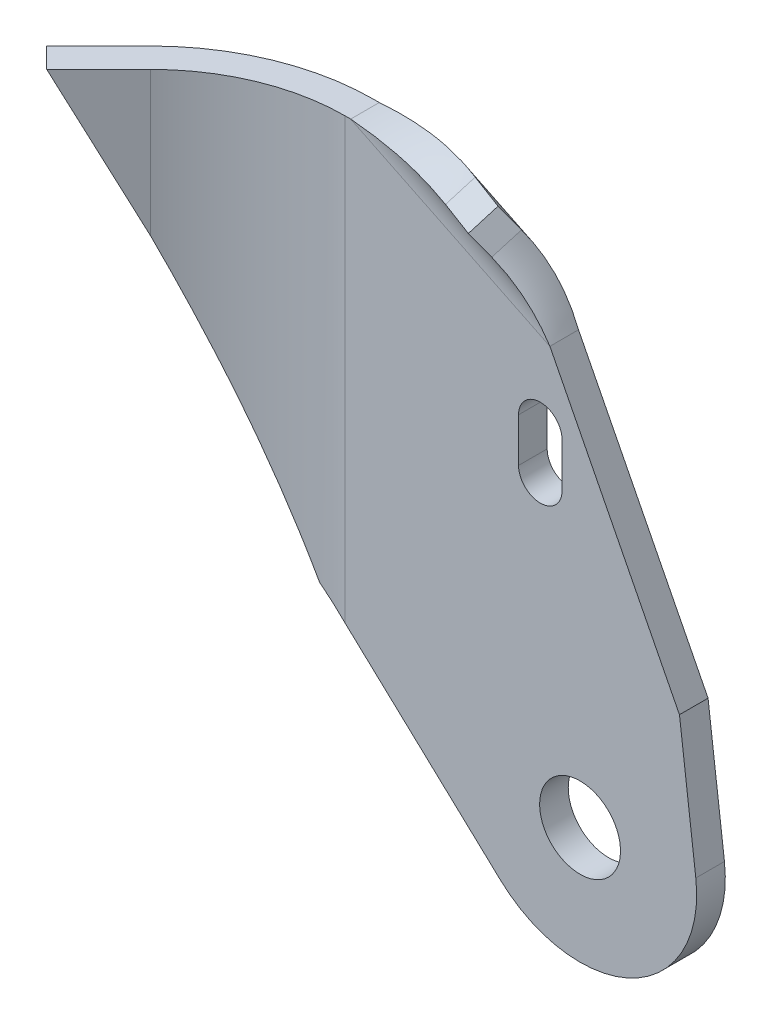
ISO-10303-21;
HEADER;
FILE_DESCRIPTION(('STEP AP214'),'2;1');
FILE_NAME('part.step','',(''),(''),'','','');
FILE_SCHEMA(('AUTOMOTIVE_DESIGN { 1 0 10303 214 1 1 1 1 }'));
ENDSEC;
DATA;
#1=APPLICATION_CONTEXT('core data for automotive mechanical design processes');
#2=APPLICATION_PROTOCOL_DEFINITION('international standard','automotive_design',2000,#1);
#3=PRODUCT_CONTEXT('',#1,'mechanical');
#4=PRODUCT('Part','Part','',(#3));
#5=PRODUCT_RELATED_PRODUCT_CATEGORY('part','',(#4));
#6=PRODUCT_DEFINITION_FORMATION('','',#4);
#7=PRODUCT_DEFINITION_CONTEXT('part definition',#1,'design');
#8=PRODUCT_DEFINITION('design','',#6,#7);
#9=PRODUCT_DEFINITION_SHAPE('','',#8);
#10=(LENGTH_UNIT() NAMED_UNIT(*) SI_UNIT(.MILLI.,.METRE.));
#11=(NAMED_UNIT(*) PLANE_ANGLE_UNIT() SI_UNIT($,.RADIAN.));
#12=(NAMED_UNIT(*) SI_UNIT($,.STERADIAN.) SOLID_ANGLE_UNIT());
#13=UNCERTAINTY_MEASURE_WITH_UNIT(LENGTH_MEASURE(1.E-05),#10,'distance_accuracy_value','');
#14=(GEOMETRIC_REPRESENTATION_CONTEXT(3) GLOBAL_UNCERTAINTY_ASSIGNED_CONTEXT((#13)) GLOBAL_UNIT_ASSIGNED_CONTEXT((#10,
#11,#12)) REPRESENTATION_CONTEXT('',''));
#15=CARTESIAN_POINT('',(0.,0.,0.));
#16=DIRECTION('',(0.,0.,1.));
#17=DIRECTION('',(1.,0.,0.));
#18=AXIS2_PLACEMENT_3D('',#15,#16,#17);
#19=CARTESIAN_POINT('',(22.5526101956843,-81.2419000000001,-71.8145263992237));
#20=DIRECTION('',(0.707106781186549,0.,0.707106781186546));
#21=DIRECTION('',(0.707106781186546,0.,-0.707106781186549));
#22=AXIS2_PLACEMENT_3D('',#19,#20,#21);
#23=PLANE('',#22);
#24=DIRECTION('',(-0.321019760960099,0.89100652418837,0.3210197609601));
#25=VECTOR('',#24,1.);
#26=CARTESIAN_POINT('',(-32.0018250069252,0.241299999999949,-17.260091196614));
#27=LINE('',#26,#25);
#28=CARTESIAN_POINT('',(-23.5065416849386,-23.3377869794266,-25.7553745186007));
#29=VERTEX_POINT('',#28);
#30=CARTESIAN_POINT('',(-32.0018250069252,0.241299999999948,-17.260091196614));
#31=VERTEX_POINT('',#30);
#32=EDGE_CURVE('E163',#29,#31,#27,.T.);
#33=ORIENTED_EDGE('',*,*,#32,.T.);
#34=DIRECTION('',(-0.707106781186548,0.,0.707106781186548));
#35=VECTOR('',#34,1.);
#36=CARTESIAN_POINT('',(-23.506541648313,0.241299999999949,-25.7553745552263));
#37=LINE('',#36,#35);
#38=CARTESIAN_POINT('',(-23.506541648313,0.241299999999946,-25.7553745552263));
#39=VERTEX_POINT('',#38);
#40=EDGE_CURVE('E165',#39,#31,#37,.T.);
#41=ORIENTED_EDGE('',*,*,#40,.F.);
#42=DIRECTION('',(0.,-1.,0.));
#43=VECTOR('',#42,1.);
#44=CARTESIAN_POINT('',(-23.506541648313,139.466006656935,-25.7553745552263));
#45=LINE('',#44,#43);
#46=EDGE_CURVE('E167',#29,#39,#45,.F.);
#47=ORIENTED_EDGE('',*,*,#46,.F.);
#48=EDGE_LOOP('',(#33,#41,#47));
#49=FACE_BOUND('',#48,.T.);
#50=ADVANCED_FACE('F16',(#49),#23,.F.);
#51=CARTESIAN_POINT('',(48.3093374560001,-65.4653502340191,-76.4626144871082));
#52=DIRECTION('',(-0.293327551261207,-0.601410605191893,0.743144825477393));
#53=DIRECTION('',(0.,-0.777338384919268,-0.629082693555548));
#54=AXIS2_PLACEMENT_3D('',#51,#52,#53);
#55=PLANE('',#54);
#56=DIRECTION('',(-0.950640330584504,0.101202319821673,-0.293327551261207));
#57=VECTOR('',#56,1.);
#58=CARTESIAN_POINT('',(27.6945736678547,0.427162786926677,-31.2741440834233));
#59=LINE('',#58,#57);
#60=CARTESIAN_POINT('',(27.6945736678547,0.427162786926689,-31.2741440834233));
#61=VERTEX_POINT('',#60);
#62=CARTESIAN_POINT('',(22.2966394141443,1.00181068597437,-32.9397191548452));
#63=VERTEX_POINT('',#62);
#64=EDGE_CURVE('E183',#61,#63,#59,.T.);
#65=ORIENTED_EDGE('',*,*,#64,.F.);
#66=DIRECTION('',(-0.521753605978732,0.752071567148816,0.402692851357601));
#67=VECTOR('',#66,1.);
#68=CARTESIAN_POINT('',(29.8525950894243,-2.6834751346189,-32.9397191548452));
#69=LINE('',#68,#67);
#70=CARTESIAN_POINT('',(29.8525950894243,-2.6834751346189,-32.9397191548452));
#71=VERTEX_POINT('',#70);
#72=EDGE_CURVE('E189',#71,#61,#69,.T.);
#73=ORIENTED_EDGE('',*,*,#72,.F.);
#74=DIRECTION('',(-0.898794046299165,0.438371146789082,0.));
#75=VECTOR('',#74,1.);
#76=CARTESIAN_POINT('',(179.313545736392,-75.5804514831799,-32.9397191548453));
#77=LINE('',#76,#75);
#78=EDGE_CURVE('E138',#63,#71,#77,.F.);
#79=ORIENTED_EDGE('',*,*,#78,.F.);
#80=EDGE_LOOP('',(#65,#73,#79));
#81=FACE_BOUND('',#80,.T.);
#82=ADVANCED_FACE('F380',(#81),#55,.F.);
#83=CARTESIAN_POINT('',(-34.6512906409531,4.10762255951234,-46.6152886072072));
#84=DIRECTION('',(-0.101202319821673,0.792504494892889,0.601410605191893));
#85=DIRECTION('',(0.,-0.604514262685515,0.796594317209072));
#86=AXIS2_PLACEMENT_3D('',#83,#84,#85);
#87=PLANE('',#86);
#88=DIRECTION('',(-0.950640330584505,0.101202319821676,-0.293327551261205));
#89=VECTOR('',#88,1.);
#90=CARTESIAN_POINT('',(26.3236780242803,-2.38358981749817,-27.8009824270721));
#91=LINE('',#90,#89);
#92=CARTESIAN_POINT('',(26.3236780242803,-2.38358981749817,-27.8009824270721));
#93=VERTEX_POINT('',#92);
#94=CARTESIAN_POINT('',(20.92574377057,-1.80894191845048,-29.4665574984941));
#95=VERTEX_POINT('',#94);
#96=EDGE_CURVE('E154',#93,#95,#91,.T.);
#97=ORIENTED_EDGE('',*,*,#96,.F.);
#98=DIRECTION('',(-0.293327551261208,-0.601410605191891,0.743144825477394));
#99=VECTOR('',#98,1.);
#100=CARTESIAN_POINT('',(27.6945736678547,0.427162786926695,-31.2741440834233));
#101=LINE('',#100,#99);
#102=EDGE_CURVE('E192',#61,#93,#101,.T.);
#103=ORIENTED_EDGE('',*,*,#102,.F.);
#104=ORIENTED_EDGE('',*,*,#64,.T.);
#105=DIRECTION('',(0.293327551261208,0.601410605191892,-0.743144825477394));
#106=VECTOR('',#105,1.);
#107=CARTESIAN_POINT('',(21.6111921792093,-0.403564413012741,-31.2031398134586));
#108=LINE('',#107,#106);
#109=EDGE_CURVE('E199',#95,#63,#108,.T.);
#110=ORIENTED_EDGE('',*,*,#109,.F.);
#111=EDGE_LOOP('',(#97,#103,#104,#110));
#112=FACE_BOUND('',#111,.T.);
#113=ADVANCED_FACE('F383',(#112),#87,.T.);
#114=CARTESIAN_POINT('',(-28.6970907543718,0.241299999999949,-13.9553569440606));
#115=DIRECTION('',(0.630036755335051,0.453990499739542,-0.630036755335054));
#116=DIRECTION('',(-0.707106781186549,0.,-0.707106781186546));
#117=AXIS2_PLACEMENT_3D('',#114,#115,#116);
#118=PLANE('',#117);
#119=DIRECTION('',(0.321019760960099,-0.89100652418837,-0.3210197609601));
#120=VECTOR('',#119,1.);
#121=CARTESIAN_POINT('',(-28.6970907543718,0.241299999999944,-13.9553569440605));
#122=LINE('',#121,#120);
#123=CARTESIAN_POINT('',(-28.6970907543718,0.241299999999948,-13.9553569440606));
#124=VERTEX_POINT('',#123);
#125=CARTESIAN_POINT('',(-20.2018074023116,-23.3377870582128,-22.4506402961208));
#126=VERTEX_POINT('',#125);
#127=EDGE_CURVE('E187',#124,#126,#122,.T.);
#128=ORIENTED_EDGE('',*,*,#127,.F.);
#129=DIRECTION('',(-0.707106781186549,0.,-0.707106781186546));
#130=VECTOR('',#129,1.);
#131=CARTESIAN_POINT('',(-28.6970907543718,0.241299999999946,-13.9553569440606));
#132=LINE('',#131,#130);
#133=EDGE_CURVE('E173',#31,#124,#132,.F.);
#134=ORIENTED_EDGE('',*,*,#133,.F.);
#135=ORIENTED_EDGE('',*,*,#32,.F.);
#136=DIRECTION('',(0.707106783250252,-1.73709898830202E-13,0.707106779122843));
#137=VECTOR('',#136,1.);
#138=CARTESIAN_POINT('',(-21.8541745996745,-23.3377868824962,-24.1030073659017));
#139=LINE('',#138,#137);
#140=CARTESIAN_POINT('',(-21.8541711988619,-23.3377869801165,-24.1030040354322));
#141=VERTEX_POINT('',#140);
#142=EDGE_CURVE('E342',#29,#141,#139,.T.);
#143=ORIENTED_EDGE('',*,*,#142,.T.);
#144=DIRECTION('',(0.707106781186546,0.,0.707106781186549));
#145=VECTOR('',#144,1.);
#146=CARTESIAN_POINT('',(-21.8541745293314,-23.3377870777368,-24.1030074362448));
#147=LINE('',#146,#145);
#148=EDGE_CURVE('E284',#141,#126,#147,.T.);
#149=ORIENTED_EDGE('',*,*,#148,.T.);
#150=EDGE_LOOP('',(#128,#134,#135,#143,#149));
#151=FACE_BOUND('',#150,.T.);
#152=ADVANCED_FACE('F185',(#151),#118,.F.);
#153=CARTESIAN_POINT('',(26.3236780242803,-2.38358981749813,-27.8009824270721));
#154=DIRECTION('',(0.80108184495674,0.269617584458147,0.534391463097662));
#155=DIRECTION('',(0.554942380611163,0.,-0.831888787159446));
#156=AXIS2_PLACEMENT_3D('',#153,#154,#155);
#157=PLANE('',#156);
#158=ORIENTED_EDGE('',*,*,#72,.T.);
#159=ORIENTED_EDGE('',*,*,#102,.T.);
#160=DIRECTION('',(-0.521753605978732,0.752071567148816,0.402692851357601));
#161=VECTOR('',#160,1.);
#162=CARTESIAN_POINT('',(28.4816994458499,-5.49422773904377,-29.466557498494));
#163=LINE('',#162,#161);
#164=CARTESIAN_POINT('',(28.4816994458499,-5.49422773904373,-29.466557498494));
#165=VERTEX_POINT('',#164);
#166=EDGE_CURVE('E302',#165,#93,#163,.T.);
#167=ORIENTED_EDGE('',*,*,#166,.F.);
#168=DIRECTION('',(-0.293327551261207,-0.601410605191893,0.743144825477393));
#169=VECTOR('',#168,1.);
#170=CARTESIAN_POINT('',(29.1671483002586,-4.08884931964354,-31.2031409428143));
#171=LINE('',#170,#169);
#172=EDGE_CURVE('E348',#71,#165,#171,.T.);
#173=ORIENTED_EDGE('',*,*,#172,.F.);
#174=EDGE_LOOP('',(#158,#159,#167,#173));
#175=FACE_BOUND('',#174,.T.);
#176=ADVANCED_FACE('F329',(#175),#157,.T.);
#177=CARTESIAN_POINT('',(2.2488329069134,139.466006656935,0.));
#178=DIRECTION('',(0.,-1.,0.));
#179=DIRECTION('',(0.,0.,-1.));
#180=AXIS2_PLACEMENT_3D('',#177,#178,#179);
#181=CYLINDRICAL_SURFACE('',#180,36.4236);
#182=DIRECTION('',(0.,1.,0.));
#183=VECTOR('',#182,1.);
#184=CARTESIAN_POINT('',(2.2488329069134,-81.2419000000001,-36.4236));
#185=LINE('',#184,#183);
#186=CARTESIAN_POINT('',(2.2488329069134,0.241299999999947,-36.4236));
#187=VERTEX_POINT('',#186);
#188=CARTESIAN_POINT('',(2.2488329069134,-71.5128315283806,-36.4236));
#189=VERTEX_POINT('',#188);
#190=EDGE_CURVE('E352',#187,#189,#185,.F.);
#191=ORIENTED_EDGE('',*,*,#190,.T.);
#192=CARTESIAN_POINT('',(2.2488329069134,-71.5128315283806,-36.4236));
#193=CARTESIAN_POINT('',(2.06006403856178,-71.3480951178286,-36.4236001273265));
#194=CARTESIAN_POINT('',(1.87129517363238,-71.1833587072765,-36.4221325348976));
#195=CARTESIAN_POINT('',(1.49380307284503,-70.8538858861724,-36.4162628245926));
#196=CARTESIAN_POINT('',(1.30507983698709,-70.6891494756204,-36.4118607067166));
#197=CARTESIAN_POINT('',(0.927724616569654,-70.3596766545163,-36.4001228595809));
#198=CARTESIAN_POINT('',(0.739092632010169,-70.1949402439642,-36.3927871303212));
#199=CARTESIAN_POINT('',(0.361965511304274,-69.8654674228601,-36.3751838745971));
#200=CARTESIAN_POINT('',(0.173470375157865,-69.7007310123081,-36.3649163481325));
#201=CARTESIAN_POINT('',(-0.203337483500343,-69.371258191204,-36.3414519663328));
#202=CARTESIAN_POINT('',(-0.391650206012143,-69.2065217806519,-36.3282551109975));
#203=CARTESIAN_POINT('',(-0.768047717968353,-68.8770489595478,-36.298935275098));
#204=CARTESIAN_POINT('',(-0.956132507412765,-68.7123125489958,-36.2828122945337));
#205=CARTESIAN_POINT('',(-1.33202868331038,-68.3828397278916,-36.2476440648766));
#206=CARTESIAN_POINT('',(-1.51984006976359,-68.2181033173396,-36.2285988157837));
#207=CARTESIAN_POINT('',(-1.89514405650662,-67.8886304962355,-36.1875908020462));
#208=CARTESIAN_POINT('',(-2.08263665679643,-67.7238940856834,-36.1656280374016));
#209=CARTESIAN_POINT('',(-2.26994717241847,-67.5591576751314,-36.1422088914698));
#210=B_SPLINE_CURVE_WITH_KNOTS('',3,(#192,#193,#194,#195,#196,#197,#198,#199,#200,#201,#202,
#203,#204,#205,#206,#207,#208,#209),.UNSPECIFIED.,.F.,.F.,(4,2,2,2,2,2,2,2,4),(0.,
0.751624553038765,1.50324910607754,2.2548736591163,3.00649821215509,3.75812276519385,
4.50974731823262,5.26137187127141,6.01299642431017),.UNSPECIFIED.);
#211=CARTESIAN_POINT('',(-2.26994740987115,-67.559157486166,-36.1422088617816));
#212=VERTEX_POINT('',#211);
#213=EDGE_CURVE('E283',#212,#189,#210,.F.);
#214=ORIENTED_EDGE('',*,*,#213,.F.);
#215=CARTESIAN_POINT('',(-2.26994764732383,-67.5591572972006,-36.1422088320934));
#216=CARTESIAN_POINT('',(-3.02140147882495,-66.1682044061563,-36.0482882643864));
#217=CARTESIAN_POINT('',(-3.76991118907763,-64.7772567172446,-35.9308707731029));
#218=CARTESIAN_POINT('',(-5.25832548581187,-61.9950801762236,-35.6496049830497));
#219=CARTESIAN_POINT('',(-5.99822826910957,-60.6038513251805,-35.485747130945));
#220=CARTESIAN_POINT('',(-7.51450813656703,-57.7302198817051,-35.09996276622));
#221=CARTESIAN_POINT('',(-8.29009782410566,-56.2478172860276,-34.8749344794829));
#222=CARTESIAN_POINT('',(-9.82464178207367,-53.2829260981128,-34.3738465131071));
#223=CARTESIAN_POINT('',(-10.583595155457,-51.8004375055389,-34.0977840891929));
#224=CARTESIAN_POINT('',(-12.0816245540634,-48.8351428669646,-33.4957969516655));
#225=CARTESIAN_POINT('',(-12.8206963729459,-47.352336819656,-33.169861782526));
#226=CARTESIAN_POINT('',(-14.2755498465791,-44.3867358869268,-32.4696024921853));
#227=CARTESIAN_POINT('',(-14.9913319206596,-42.9039410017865,-32.0952792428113));
#228=CARTESIAN_POINT('',(-16.1699027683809,-40.416494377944,-31.4281419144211));
#229=CARTESIAN_POINT('',(-16.6398527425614,-39.4118232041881,-31.1479603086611));
#230=CARTESIAN_POINT('',(-17.5666747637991,-37.4024721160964,-30.5667054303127));
#231=CARTESIAN_POINT('',(-18.0235467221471,-36.3977922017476,-30.2656320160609));
#232=CARTESIAN_POINT('',(-18.923269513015,-34.3884320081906,-29.6432108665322));
#233=CARTESIAN_POINT('',(-19.3661202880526,-33.3837517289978,-29.3218630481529));
#234=CARTESIAN_POINT('',(-20.2368519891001,-31.3744868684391,-28.6595845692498));
#235=CARTESIAN_POINT('',(-20.6647343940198,-30.3699022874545,-28.3186558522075));
#236=CARTESIAN_POINT('',(-21.5047004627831,-28.3607283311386,-27.6178819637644));
#237=CARTESIAN_POINT('',(-21.9167841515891,-27.3561389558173,-27.2580368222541));
#238=CARTESIAN_POINT('',(-22.72433227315,-25.3469612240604,-26.5201616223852));
#239=CARTESIAN_POINT('',(-23.1197967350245,-24.3423728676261,-26.1421315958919));
#240=CARTESIAN_POINT('',(-23.506541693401,-23.3377869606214,-25.7553745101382));
#241=B_SPLINE_CURVE_WITH_KNOTS('',3,(#215,#216,#217,#218,#219,#220,#221,#222,#223,#224,#225,
#226,#227,#228,#229,#230,#231,#232,#233,#234,#235,#236,#237,#238,#239,#240),.UNSPECIFIED.,.F.,
.F.,(4,2,2,2,2,2,2,2,2,2,2,2,4),(0.,4.75104964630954,9.50307735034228,14.5665275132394,
19.6302500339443,24.6950355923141,29.7597299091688,33.1914650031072,36.6232233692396,
40.0549958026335,43.4864282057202,46.917855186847,50.3492761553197),.UNSPECIFIED.);
#242=EDGE_CURVE('E336',#212,#29,#241,.T.);
#243=ORIENTED_EDGE('',*,*,#242,.T.);
#244=ORIENTED_EDGE('',*,*,#46,.T.);
#245=CARTESIAN_POINT('',(2.2488329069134,0.241299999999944,0.));
#246=DIRECTION('',(0.,-1.,0.));
#247=DIRECTION('',(0.,0.,-1.));
#248=AXIS2_PLACEMENT_3D('',#245,#246,#247);
#249=CIRCLE('',#248,36.4236);
#250=EDGE_CURVE('E181',#187,#39,#249,.F.);
#251=ORIENTED_EDGE('',*,*,#250,.F.);
#252=EDGE_LOOP('',(#191,#214,#243,#244,#251));
#253=FACE_BOUND('',#252,.T.);
#254=ADVANCED_FACE('F319',(#253),#181,.T.);
#255=CARTESIAN_POINT('',(175.334968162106,-83.7377443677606,-22.86));
#256=DIRECTION('',(-0.898794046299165,0.438371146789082,0.));
#257=DIRECTION('',(-0.438371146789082,-0.898794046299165,0.));
#258=AXIS2_PLACEMENT_3D('',#255,#256,#257);
#259=CYLINDRICAL_SURFACE('',#258,13.5636);
#260=CARTESIAN_POINT('',(35.6898790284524,-15.6282835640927,-36.4236));
#261=CARTESIAN_POINT('',(35.5428095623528,-15.2584453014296,-36.4236091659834));
#262=CARTESIAN_POINT('',(35.3957389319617,-14.8886112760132,-36.4156608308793));
#263=CARTESIAN_POINT('',(35.1011899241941,-14.1497915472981,-36.3839182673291));
#264=CARTESIAN_POINT('',(34.9537115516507,-13.7808058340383,-36.3601242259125));
#265=CARTESIAN_POINT('',(34.657960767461,-13.0445700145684,-36.2967641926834));
#266=CARTESIAN_POINT('',(34.5096884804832,-12.6773196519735,-36.2572006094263));
#267=CARTESIAN_POINT('',(34.2119223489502,-11.9453612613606,-36.1624519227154));
#268=CARTESIAN_POINT('',(34.0624284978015,-11.5806532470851,-36.1072667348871));
#269=CARTESIAN_POINT('',(33.6019383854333,-10.4685181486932,-35.9145493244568));
#270=CARTESIAN_POINT('',(33.2882108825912,-9.72642571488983,-35.751844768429));
#271=CARTESIAN_POINT('',(32.6503098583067,-8.26362108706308,-35.3630428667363));
#272=CARTESIAN_POINT('',(32.3261359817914,-7.54290962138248,-35.1369433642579));
#273=CARTESIAN_POINT('',(31.8250208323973,-6.47318972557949,-34.7492817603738));
#274=CARTESIAN_POINT('',(31.6530686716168,-6.11371496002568,-34.6097357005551));
#275=CARTESIAN_POINT('',(31.3050979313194,-5.40305715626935,-34.3153518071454));
#276=CARTESIAN_POINT('',(31.1290793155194,-5.0518741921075,-34.160513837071));
#277=CARTESIAN_POINT('',(30.7725223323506,-4.35860215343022,-33.8361290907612));
#278=CARTESIAN_POINT('',(30.5919829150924,-4.01651523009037,-33.6665788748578));
#279=CARTESIAN_POINT('',(30.2260365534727,-3.34231575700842,-33.3134790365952));
#280=CARTESIAN_POINT('',(30.0406296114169,-3.01020320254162,-33.1299294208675));
#281=CARTESIAN_POINT('',(29.8525950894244,-2.68347513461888,-32.9397191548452));
#282=B_SPLINE_CURVE_WITH_KNOTS('',3,(#260,#261,#262,#263,#264,#265,#266,#267,#268,#269,#270,
#271,#272,#273,#274,#275,#276,#277,#278,#279,#280,#281),.UNSPECIFIED.,.F.,.F.,(4,2,2,2,2,2,2,2,
2,2,4),(0.,1.19393576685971,2.38785744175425,3.58159683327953,4.77534267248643,7.23821139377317,
9.70116391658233,10.9674798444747,12.2338070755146,13.5004311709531,14.7670546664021),.UNSPECIFIED.);
#283=CARTESIAN_POINT('',(35.6898790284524,-15.6282835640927,-36.4236));
#284=VERTEX_POINT('',#283);
#285=EDGE_CURVE('E317',#284,#71,#282,.T.);
#286=ORIENTED_EDGE('',*,*,#285,.F.);
#287=DIRECTION('',(-0.898794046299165,0.438371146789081,0.));
#288=VECTOR('',#287,1.);
#289=CARTESIAN_POINT('',(35.6898790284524,-15.6282835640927,-36.4236));
#290=LINE('',#289,#288);
#291=CARTESIAN_POINT('',(3.15241088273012,0.24129999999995,-36.4236));
#292=VERTEX_POINT('',#291);
#293=EDGE_CURVE('E300',#284,#292,#290,.T.);
#294=ORIENTED_EDGE('',*,*,#293,.T.);
#295=CARTESIAN_POINT('',(22.2966394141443,1.0018106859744,-32.9397191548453));
#296=CARTESIAN_POINT('',(21.9219841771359,1.01719716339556,-33.0751497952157));
#297=CARTESIAN_POINT('',(21.5460117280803,1.02985938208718,-33.2072044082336));
#298=CARTESIAN_POINT('',(20.7915448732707,1.0500122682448,-33.4643173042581));
#299=CARTESIAN_POINT('',(20.4130504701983,1.0575029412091,-33.5893755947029));
#300=CARTESIAN_POINT('',(19.2739172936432,1.07263358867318,-33.9537010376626));
#301=CARTESIAN_POINT('',(18.5096626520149,1.072930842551,-34.1821063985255));
#302=CARTESIAN_POINT('',(16.9736751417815,1.05638014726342,-34.6078185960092));
#303=CARTESIAN_POINT('',(16.201951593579,1.03955137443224,-34.8051599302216));
#304=CARTESIAN_POINT('',(14.6514914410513,0.991346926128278,-35.1674556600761));
#305=CARTESIAN_POINT('',(13.8727557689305,0.959973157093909,-35.3324142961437));
#306=CARTESIAN_POINT('',(12.2751241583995,0.883669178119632,-35.6351752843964));
#307=CARTESIAN_POINT('',(11.4559668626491,0.838203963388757,-35.7714662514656));
#308=CARTESIAN_POINT('',(9.81297084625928,0.737408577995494,-36.006157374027));
#309=CARTESIAN_POINT('',(8.98913277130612,0.682079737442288,-36.1045626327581));
#310=CARTESIAN_POINT('',(7.33072440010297,0.564246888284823,-36.2633594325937));
#311=CARTESIAN_POINT('',(6.49612438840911,0.501682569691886,-36.3233994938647));
#312=CARTESIAN_POINT('',(5.24296929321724,0.405314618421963,-36.3834923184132));
#313=CARTESIAN_POINT('',(4.82498616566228,0.372767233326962,-36.398528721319));
#314=CARTESIAN_POINT('',(3.98881107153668,0.307248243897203,-36.4185834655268));
#315=CARTESIAN_POINT('',(3.57061910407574,0.274276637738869,-36.42360176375));
#316=CARTESIAN_POINT('',(3.15241088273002,0.241299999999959,-36.4236000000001));
#317=B_SPLINE_CURVE_WITH_KNOTS('',3,(#295,#296,#297,#298,#299,#300,#301,#302,#303,#304,#305,
#306,#307,#308,#309,#310,#311,#312,#313,#314,#315,#316),.UNSPECIFIED.,.F.,.F.,(4,2,2,2,2,2,2,2,
2,2,4),(0.,1.19598233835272,2.39196340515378,4.78403432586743,7.17342974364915,9.56251206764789,
12.0565505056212,14.5502528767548,17.0664854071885,18.324935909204,19.5833918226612),.UNSPECIFIED.);
#318=EDGE_CURVE('E23',#63,#292,#317,.T.);
#319=ORIENTED_EDGE('',*,*,#318,.F.);
#320=ORIENTED_EDGE('',*,*,#78,.T.);
#321=EDGE_LOOP('',(#286,#294,#319,#320));
#322=FACE_BOUND('',#321,.T.);
#323=ADVANCED_FACE('F328',(#322),#259,.T.);
#324=CARTESIAN_POINT('',(46.9384418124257,-68.276102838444,-72.9894528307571));
#325=DIRECTION('',(-0.293327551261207,-0.601410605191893,0.743144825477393));
#326=DIRECTION('',(0.,-0.777338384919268,-0.629082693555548));
#327=AXIS2_PLACEMENT_3D('',#324,#325,#326);
#328=PLANE('',#327);
#329=DIRECTION('',(-0.898794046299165,0.438371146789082,0.));
#330=VECTOR('',#329,1.);
#331=CARTESIAN_POINT('',(177.942650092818,-78.3912040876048,-29.4665574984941));
#332=LINE('',#331,#330);
#333=EDGE_CURVE('E296',#95,#165,#332,.F.);
#334=ORIENTED_EDGE('',*,*,#333,.T.);
#335=ORIENTED_EDGE('',*,*,#166,.T.);
#336=ORIENTED_EDGE('',*,*,#96,.T.);
#337=EDGE_LOOP('',(#334,#335,#336));
#338=FACE_BOUND('',#337,.T.);
#339=ADVANCED_FACE('F370',(#338),#328,.T.);
#340=CARTESIAN_POINT('',(3.152394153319,0.24129865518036,-36.4708074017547));
#341=CARTESIAN_POINT('',(6.40907962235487,0.503092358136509,-36.4708084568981));
#342=CARTESIAN_POINT('',(9.66531633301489,0.764421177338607,-36.1627050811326));
#343=CARTESIAN_POINT('',(16.0816222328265,1.08945097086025,-34.9708616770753));
#344=CARTESIAN_POINT('',(19.2410603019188,1.15231316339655,-34.0875172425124));
#345=CARTESIAN_POINT('',(22.3105024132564,1.03020109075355,-32.9747953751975));
#346=CARTESIAN_POINT('',(3.15239416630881,0.241298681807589,-36.4236040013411));
#347=CARTESIAN_POINT('',(6.40655093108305,0.497908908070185,-36.4236050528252));
#348=CARTESIAN_POINT('',(9.66026093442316,0.754056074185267,-36.1165702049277));
#349=CARTESIAN_POINT('',(16.0718464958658,1.06940773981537,-34.9288602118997));
#350=CARTESIAN_POINT('',(19.2290935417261,1.12777653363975,-34.0485791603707));
#351=CARTESIAN_POINT('',(22.296656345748,1.00181244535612,-32.9397164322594));
#352=CARTESIAN_POINT('',(3.15239545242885,0.24130131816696,-31.7499999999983));
#353=CARTESIAN_POINT('',(6.15618545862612,-0.015303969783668,-31.750000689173));
#354=CARTESIAN_POINT('',(9.15972642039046,-0.272191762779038,-31.5487606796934));
#355=CARTESIAN_POINT('',(15.1039517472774,-0.915070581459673,-30.770299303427));
#356=CARTESIAN_POINT('',(18.0442657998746,-1.30159274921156,-30.1933235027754));
#357=CARTESIAN_POINT('',(20.9257585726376,-1.80894452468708,-29.4665537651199));
#358=CARTESIAN_POINT('',(3.15239546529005,0.241301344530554,-31.7032639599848));
#359=CARTESIAN_POINT('',(6.15368180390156,-0.0204360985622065,-31.7032646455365));
#360=CARTESIAN_POINT('',(9.15472107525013,-0.282454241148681,-31.503082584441));
#361=CARTESIAN_POINT('',(15.0942727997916,-0.934915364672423,-30.7287136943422));
#362=CARTESIAN_POINT('',(18.032417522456,-1.32588644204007,-30.1547709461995));
#363=CARTESIAN_POINT('',(20.9120495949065,-1.83705209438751,-29.4318221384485));
#364=B_SPLINE_SURFACE_WITH_KNOTS('',1,3,((#340,#341,#342,#343,#344,#345),(#346,#347,#348,#349,
#350,#351),(#352,#353,#354,#355,#356,#357),(#358,#359,#360,#361,#362,#363)),.UNSPECIFIED.,.F.,
.F.,.F.,(2,1,1,2),(4,2,4),(-0.010100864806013,-8.56158809E-07,1.,1.01000000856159),
(-8.56158809E-07,0.5,1.00000085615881),.UNSPECIFIED.);
#365=DIRECTION('',(0.,0.,1.));
#366=VECTOR('',#365,1.);
#367=CARTESIAN_POINT('',(3.15241088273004,0.241299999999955,-34.0868020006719));
#368=LINE('',#367,#366);
#369=CARTESIAN_POINT('',(3.15241088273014,0.241299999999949,-31.75));
#370=VERTEX_POINT('',#369);
#371=EDGE_CURVE('E146',#292,#370,#368,.T.);
#372=CARTESIAN_POINT('',(3.15241088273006,0.241299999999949,-31.75));
#373=CARTESIAN_POINT('',(3.54368263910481,0.207873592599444,-31.7500014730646));
#374=CARTESIAN_POINT('',(3.93494618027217,0.174445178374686,-31.7466223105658));
#375=CARTESIAN_POINT('',(4.71733186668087,0.107299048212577,-31.7331186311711));
#376=CARTESIAN_POINT('',(5.10845401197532,0.073581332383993,-31.7229941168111));
#377=CARTESIAN_POINT('',(6.28131664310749,-0.0284246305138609,-31.6825300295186));
#378=CARTESIAN_POINT('',(7.06265817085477,-0.0975744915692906,-31.6420999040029));
#379=CARTESIAN_POINT('',(8.62308494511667,-0.240491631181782,-31.5346952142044));
#380=CARTESIAN_POINT('',(9.40217015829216,-0.314258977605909,-31.4677202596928));
#381=CARTESIAN_POINT('',(10.9570514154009,-0.468676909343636,-31.3078351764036));
#382=CARTESIAN_POINT('',(11.7328472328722,-0.549327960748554,-31.2149232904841));
#383=CARTESIAN_POINT('',(13.2173775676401,-0.712790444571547,-31.0125527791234));
#384=CARTESIAN_POINT('',(13.9264561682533,-0.794898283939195,-30.9050428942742));
#385=CARTESIAN_POINT('',(15.340129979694,-0.968390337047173,-30.6696483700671));
#386=CARTESIAN_POINT('',(16.044724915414,-1.05977511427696,-30.5417624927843));
#387=CARTESIAN_POINT('',(17.4489811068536,-1.25346264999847,-30.2665340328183));
#388=CARTESIAN_POINT('',(18.1486396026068,-1.35577106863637,-30.1191813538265));
#389=CARTESIAN_POINT('',(19.5419018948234,-1.57273117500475,-29.8062483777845));
#390=CARTESIAN_POINT('',(20.235505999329,-1.68738223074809,-29.6406690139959));
#391=CARTESIAN_POINT('',(20.9257437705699,-1.80894191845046,-29.4665574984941));
#392=B_SPLINE_CURVE_WITH_KNOTS('',3,(#372,#373,#374,#375,#376,#377,#378,#379,#380,#381,#382,
#383,#384,#385,#386,#387,#388,#389,#390,#391),.UNSPECIFIED.,.F.,.F.,(4,2,2,2,2,2,2,2,2,4),(0.,
1.17806039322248,2.3561203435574,4.71192476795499,7.06776382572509,9.42376252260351,
11.5890103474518,13.7543897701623,15.9208966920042,18.0872927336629),.UNSPECIFIED.);
#393=EDGE_CURVE('E357',#370,#95,#392,.T.);
#394=ORIENTED_EDGE('',*,*,#109,.T.);
#395=ORIENTED_EDGE('',*,*,#318,.T.);
#396=ORIENTED_EDGE('',*,*,#371,.T.);
#397=ORIENTED_EDGE('',*,*,#393,.T.);
#398=EDGE_LOOP('',(#394,#395,#396,#397));
#399=FACE_BOUND('',#398,.T.);
#400=ADVANCED_FACE('F363',(#399),#364,.T.);
#401=CARTESIAN_POINT('',(25.8573444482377,-81.2419000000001,-68.5097921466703));
#402=DIRECTION('',(0.707106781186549,0.,0.707106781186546));
#403=DIRECTION('',(0.707106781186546,0.,-0.707106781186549));
#404=AXIS2_PLACEMENT_3D('',#401,#402,#403);
#405=PLANE('',#404);
#406=DIRECTION('',(0.,-1.,0.));
#407=VECTOR('',#406,1.);
#408=CARTESIAN_POINT('',(-20.2018073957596,139.466006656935,-22.4506403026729));
#409=LINE('',#408,#407);
#410=CARTESIAN_POINT('',(-20.2018073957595,0.241299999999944,-22.4506403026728));
#411=VERTEX_POINT('',#410);
#412=EDGE_CURVE('E362',#126,#411,#409,.F.);
#413=ORIENTED_EDGE('',*,*,#412,.T.);
#414=DIRECTION('',(0.707106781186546,0.,-0.707106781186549));
#415=VECTOR('',#414,1.);
#416=CARTESIAN_POINT('',(25.8573444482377,0.241299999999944,-68.5097921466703));
#417=LINE('',#416,#415);
#418=EDGE_CURVE('E286',#411,#124,#417,.F.);
#419=ORIENTED_EDGE('',*,*,#418,.T.);
#420=ORIENTED_EDGE('',*,*,#127,.T.);
#421=EDGE_LOOP('',(#413,#419,#420));
#422=FACE_BOUND('',#421,.T.);
#423=ADVANCED_FACE('F369',(#422),#405,.T.);
#424=CARTESIAN_POINT('',(2.2488329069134,0.241299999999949,0.));
#425=DIRECTION('',(0.,1.,0.));
#426=DIRECTION('',(0.,0.,1.));
#427=AXIS2_PLACEMENT_3D('',#424,#425,#426);
#428=PLANE('',#427);
#429=CARTESIAN_POINT('',(2.2488329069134,0.241299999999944,0.));
#430=DIRECTION('',(0.,-1.,0.));
#431=DIRECTION('',(0.,0.,-1.));
#432=AXIS2_PLACEMENT_3D('',#429,#430,#431);
#433=CIRCLE('',#432,31.75);
#434=CARTESIAN_POINT('',(2.2488329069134,0.241299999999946,-31.75));
#435=VERTEX_POINT('',#434);
#436=EDGE_CURVE('E248',#411,#435,#433,.T.);
#437=ORIENTED_EDGE('',*,*,#436,.T.);
#438=DIRECTION('',(1.,0.,0.));
#439=VECTOR('',#438,1.);
#440=CARTESIAN_POINT('',(-36.5370221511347,0.241299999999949,-31.75));
#441=LINE('',#440,#439);
#442=EDGE_CURVE('E174',#435,#370,#441,.T.);
#443=ORIENTED_EDGE('',*,*,#442,.T.);
#444=ORIENTED_EDGE('',*,*,#371,.F.);
#445=DIRECTION('',(1.,0.,0.));
#446=VECTOR('',#445,1.);
#447=CARTESIAN_POINT('',(-36.5370221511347,0.241299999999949,-36.4236));
#448=LINE('',#447,#446);
#449=EDGE_CURVE('E182',#292,#187,#448,.F.);
#450=ORIENTED_EDGE('',*,*,#449,.T.);
#451=ORIENTED_EDGE('',*,*,#250,.T.);
#452=ORIENTED_EDGE('',*,*,#40,.T.);
#453=ORIENTED_EDGE('',*,*,#133,.T.);
#454=ORIENTED_EDGE('',*,*,#418,.F.);
#455=EDGE_LOOP('',(#437,#443,#444,#450,#451,#452,#453,#454));
#456=FACE_BOUND('',#455,.T.);
#457=ADVANCED_FACE('F178',(#456),#428,.T.);
#458=CARTESIAN_POINT('',(-23.5399195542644,-23.3377868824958,-25.7887523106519));
#459=CARTESIAN_POINT('',(-20.6987317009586,-30.7081684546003,-28.62994018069));
#460=CARTESIAN_POINT('',(-17.384488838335,-38.0782437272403,-30.99671277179));
#461=CARTESIAN_POINT('',(-10.1657423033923,-52.8187005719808,-34.5274071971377));
#462=CARTESIAN_POINT('',(-6.26280864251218,-60.1887758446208,-35.6905611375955));
#463=CARTESIAN_POINT('',(-2.27580372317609,-67.5591574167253,-36.1890475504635));
#464=CARTESIAN_POINT('',(-23.5065417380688,-23.3377868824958,-25.7553744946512));
#465=CARTESIAN_POINT('',(-20.6690312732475,-30.708168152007,-28.5928849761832));
#466=CARTESIAN_POINT('',(-17.3590778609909,-38.0782437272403,-30.9565944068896));
#467=CARTESIAN_POINT('',(-10.1496743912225,-52.8187005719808,-34.4827191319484));
#468=CARTESIAN_POINT('',(-6.25179206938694,-60.1887761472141,-35.644367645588));
#469=CARTESIAN_POINT('',(-2.26994758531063,-67.5591574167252,-36.1422088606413));
#470=CARTESIAN_POINT('',(-20.2018074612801,-23.3377868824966,-22.4506402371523));
#471=CARTESIAN_POINT('',(-17.7283948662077,-30.7081381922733,-24.9240528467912));
#472=CARTESIAN_POINT('',(-14.8431395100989,-38.0782437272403,-26.9844790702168));
#473=CARTESIAN_POINT('',(-8.55879199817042,-52.8187005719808,-30.0581582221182));
#474=CARTESIAN_POINT('',(-5.16104225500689,-60.1888061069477,-31.0707545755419));
#475=CARTESIAN_POINT('',(-1.69013195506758,-67.5591574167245,-31.5047148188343));
#476=CARTESIAN_POINT('',(-20.1687601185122,-23.3377868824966,-22.4175928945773));
#477=CARTESIAN_POINT('',(-17.6989885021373,-30.708137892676,-24.8873645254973));
#478=CARTESIAN_POINT('',(-14.81798012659,-38.0782437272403,-26.9447579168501));
#479=CARTESIAN_POINT('',(-8.5428831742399,-52.8187005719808,-30.0139126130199));
#480=CARTESIAN_POINT('',(-5.15013475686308,-60.1888064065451,-31.0250184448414));
#481=CARTESIAN_POINT('',(-1.68433379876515,-67.5591574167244,-31.4583398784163));
#482=B_SPLINE_SURFACE_WITH_KNOTS('',1,3,((#458,#459,#460,#461,#462,#463),(#464,#465,#466,#467,
#468,#469),(#470,#471,#472,#473,#474,#475),(#476,#477,#478,#479,#480,#481)),.UNSPECIFIED.,.F.,
.F.,.F.,(2,1,1,2),(4,2,4),(-0.0101000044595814,-4.41499E-09,1.,1.01000000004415),(-4.41499E-09,
0.5,1.00000000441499),.UNSPECIFIED.);
#483=CARTESIAN_POINT('',(-1.69013192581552,-67.5591574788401,-31.5047148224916));
#484=CARTESIAN_POINT('',(-2.35720161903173,-66.142644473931,-31.4213428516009));
#485=CARTESIAN_POINT('',(-3.02161100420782,-64.7261346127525,-31.3167265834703));
#486=CARTESIAN_POINT('',(-4.34257359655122,-61.8928861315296,-31.0655345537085));
#487=CARTESIAN_POINT('',(-4.99912549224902,-60.4761475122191,-30.9189518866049));
#488=CARTESIAN_POINT('',(-6.33004897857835,-57.5808193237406,-30.5770804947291));
#489=CARTESIAN_POINT('',(-7.00394709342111,-56.102229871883,-30.3799447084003));
#490=CARTESIAN_POINT('',(-8.33721440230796,-53.1449820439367,-29.9414522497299));
#491=CARTESIAN_POINT('',(-8.9965829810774,-51.6663236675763,-29.7000937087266));
#492=CARTESIAN_POINT('',(-10.2979695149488,-48.7087606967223,-29.1741820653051));
#493=CARTESIAN_POINT('',(-10.9399846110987,-47.2298561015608,-28.8896218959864));
#494=CARTESIAN_POINT('',(-12.2037455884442,-44.2720553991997,-28.2785792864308));
#495=CARTESIAN_POINT('',(-12.8254917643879,-42.7931592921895,-27.9520974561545));
#496=CARTESIAN_POINT('',(-13.8478462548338,-40.3155538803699,-27.3712284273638));
#497=CARTESIAN_POINT('',(-14.2547146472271,-39.3168286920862,-27.1278474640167));
#498=CARTESIAN_POINT('',(-15.0571611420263,-37.3193716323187,-26.6231050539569));
#499=CARTESIAN_POINT('',(-15.4527391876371,-36.3206397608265,-26.3617435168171));
#500=CARTESIAN_POINT('',(-16.2317987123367,-34.3231758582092,-25.8215692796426));
#501=CARTESIAN_POINT('',(-16.6152801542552,-33.3244438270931,-25.542756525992));
#502=CARTESIAN_POINT('',(-17.369341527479,-31.3270557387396,-24.9682675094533));
#503=CARTESIAN_POINT('',(-17.7399224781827,-30.3283996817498,-24.6725925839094));
#504=CARTESIAN_POINT('',(-18.4674660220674,-28.3310835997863,-24.0649550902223));
#505=CARTESIAN_POINT('',(-18.8244286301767,-27.332423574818,-23.7529925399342));
#506=CARTESIAN_POINT('',(-19.524033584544,-25.3351040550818,-23.1134060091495));
#507=CARTESIAN_POINT('',(-19.8666759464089,-24.3364445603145,-22.7857820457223));
#508=CARTESIAN_POINT('',(-20.2018074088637,-23.3377870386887,-22.4506402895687));
#509=B_SPLINE_CURVE_WITH_KNOTS('',3,(#483,#484,#485,#486,#487,#488,#489,#490,#491,#492,#493,
#494,#495,#496,#497,#498,#499,#500,#501,#502,#503,#504,#505,#506,#507,#508),.UNSPECIFIED.,.F.,
.F.,(4,2,2,2,2,2,2,2,2,2,2,2,4),(0.,4.70367171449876,9.40811785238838,14.3179562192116,
19.2280021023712,24.138852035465,29.0496305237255,32.3660774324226,35.6825410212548,
38.9990147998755,42.315225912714,45.6314333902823,48.9476372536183),.UNSPECIFIED.);
#510=CARTESIAN_POINT('',(-1.69013204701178,-67.5591572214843,-31.5047148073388));
#511=VERTEX_POINT('',#510);
#512=EDGE_CURVE('E237',#511,#126,#509,.T.);
#513=DIRECTION('',(-0.124061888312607,0.,-0.992274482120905));
#514=VECTOR('',#513,1.);
#515=CARTESIAN_POINT('',(-1.98003988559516,-67.5591572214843,-33.8234619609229));
#516=LINE('',#515,#514);
#517=EDGE_CURVE('E274',#511,#212,#516,.T.);
#518=ORIENTED_EDGE('',*,*,#512,.T.);
#519=ORIENTED_EDGE('',*,*,#148,.F.);
#520=ORIENTED_EDGE('',*,*,#142,.F.);
#521=ORIENTED_EDGE('',*,*,#242,.F.);
#522=ORIENTED_EDGE('',*,*,#517,.F.);
#523=EDGE_LOOP('',(#518,#519,#520,#521,#522));
#524=FACE_BOUND('',#523,.T.);
#525=ADVANCED_FACE('F250',(#524),#482,.F.);
#526=CARTESIAN_POINT('',(2.24883318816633,-71.5128317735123,-36.4703362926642));
#527=CARTESIAN_POINT('',(0.736738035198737,-70.1949348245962,-36.4703363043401));
#528=CARTESIAN_POINT('',(-0.775332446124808,-68.8770541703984,-36.3761774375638));
#529=CARTESIAN_POINT('',(-2.27574588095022,-67.5591572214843,-36.1885840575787));
#530=CARTESIAN_POINT('',(2.24883318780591,-71.5128317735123,-36.4236002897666));
#531=CARTESIAN_POINT('',(0.738675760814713,-70.1949348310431,-36.4236003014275));
#532=CARTESIAN_POINT('',(-0.771457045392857,-68.8770541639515,-36.3295620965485));
#533=CARTESIAN_POINT('',(-2.26994772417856,-67.5591572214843,-36.142209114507));
#534=CARTESIAN_POINT('',(2.24883315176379,-71.5128317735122,-31.75));
#535=CARTESIAN_POINT('',(0.932448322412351,-70.1949354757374,-31.7500000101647));
#536=CARTESIAN_POINT('',(-0.383916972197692,-68.8770535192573,-31.6680279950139));
#537=CARTESIAN_POINT('',(-1.69013204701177,-67.5591572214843,-31.5047148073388));
#538=B_SPLINE_SURFACE_WITH_KNOTS('',1,3,((#526,#527,#528,#529),(#530,#531,#532,#533),(#534,#535,
#536,#537)),.UNSPECIFIED.,.F.,.F.,.F.,(2,1,2),(4,4),(-0.0100000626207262,-6.2000719E-08,1.),
(-6.2000719E-08,1.),.UNSPECIFIED.);
#539=DIRECTION('',(0.,0.,1.));
#540=VECTOR('',#539,1.);
#541=CARTESIAN_POINT('',(2.24883290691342,-71.5128315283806,-31.75));
#542=LINE('',#541,#540);
#543=CARTESIAN_POINT('',(2.24883290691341,-71.5128315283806,-31.75));
#544=VERTEX_POINT('',#543);
#545=EDGE_CURVE('E236',#544,#189,#542,.F.);
#546=CARTESIAN_POINT('',(2.2488329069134,-71.5128315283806,-31.7500000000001));
#547=CARTESIAN_POINT('',(2.08428540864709,-71.3480950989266,-31.750000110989));
#548=CARTESIAN_POINT('',(1.91973791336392,-71.1833586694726,-31.7487208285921));
#549=CARTESIAN_POINT('',(1.59068269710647,-70.8538858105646,-31.7436042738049));
#550=CARTESIAN_POINT('',(1.4261749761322,-70.6891493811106,-31.7397670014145));
#551=CARTESIAN_POINT('',(1.09723907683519,-70.3596765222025,-31.7295352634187));
#552=CARTESIAN_POINT('',(0.932810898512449,-70.1949400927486,-31.7231407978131));
#553=CARTESIAN_POINT('',(0.60407383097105,-69.8654672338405,-31.7077962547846));
#554=CARTESIAN_POINT('',(0.439764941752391,-69.7007308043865,-31.6988461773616));
#555=CARTESIAN_POINT('',(0.111306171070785,-69.3712579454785,-31.6783925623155));
#556=CARTESIAN_POINT('',(-0.0528437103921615,-69.2065215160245,-31.6668890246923));
#557=CARTESIAN_POINT('',(-0.38094478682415,-68.8770486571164,-31.6413312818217));
#558=CARTESIAN_POINT('',(-0.544895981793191,-68.7123122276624,-31.6272770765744));
#559=CARTESIAN_POINT('',(-0.872560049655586,-68.3828393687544,-31.5966213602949));
#560=CARTESIAN_POINT('',(-1.03627292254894,-68.2181029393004,-31.5800198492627));
#561=CARTESIAN_POINT('',(-1.36342078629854,-67.8886300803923,-31.5442736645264));
#562=CARTESIAN_POINT('',(-1.52685577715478,-67.7238936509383,-31.5251289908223));
#563=CARTESIAN_POINT('',(-1.69013204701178,-67.5591572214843,-31.5047148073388));
#564=B_SPLINE_CURVE_WITH_KNOTS('',3,(#546,#547,#548,#549,#550,#551,#552,#553,#554,#555,#556,
#557,#558,#559,#560,#561,#562,#563),.UNSPECIFIED.,.F.,.F.,(4,2,2,2,2,2,2,2,4),(0.,
0.698513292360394,1.39702658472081,2.0955398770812,2.79405316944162,3.49256646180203,
4.1910797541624,4.88959304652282,5.58810633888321),.UNSPECIFIED.);
#565=EDGE_CURVE('E247',#544,#511,#564,.T.);
#566=ORIENTED_EDGE('',*,*,#517,.T.);
#567=ORIENTED_EDGE('',*,*,#213,.T.);
#568=ORIENTED_EDGE('',*,*,#545,.F.);
#569=ORIENTED_EDGE('',*,*,#565,.T.);
#570=EDGE_LOOP('',(#566,#567,#568,#569));
#571=FACE_BOUND('',#570,.T.);
#572=ADVANCED_FACE('F509',(#571),#538,.T.);
#573=CARTESIAN_POINT('',(29.8664333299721,-2.65506500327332,-32.974793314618));
#574=CARTESIAN_POINT('',(30.960762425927,-4.56379823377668,-34.087547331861));
#575=CARTESIAN_POINT('',(31.9647409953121,-6.65725979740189,-34.9708636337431));
#576=CARTESIAN_POINT('',(33.8756223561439,-11.0437354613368,-36.1627088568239));
#577=CARTESIAN_POINT('',(34.7828070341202,-13.3356539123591,-36.4708123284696));
#578=CARTESIAN_POINT('',(35.6898872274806,-15.6283042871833,-36.4708104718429));
#579=CARTESIAN_POINT('',(29.8525872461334,-2.68345368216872,-32.9397143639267));
#580=CARTESIAN_POINT('',(30.9487948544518,-4.58833429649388,-34.0486090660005));
#581=CARTESIAN_POINT('',(31.9549652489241,-6.67730304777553,-34.9288621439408));
#582=CARTESIAN_POINT('',(33.8705669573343,-11.0541005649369,-36.1165739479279));
#583=CARTESIAN_POINT('',(34.7802791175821,-13.3408380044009,-36.4236088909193));
#584=CARTESIAN_POINT('',(35.6898872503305,-15.6283042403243,-36.4236070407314));
#585=CARTESIAN_POINT('',(28.4816878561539,-5.49421396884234,-29.4665509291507));
#586=CARTESIAN_POINT('',(29.7638867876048,-7.01764743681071,-30.1933352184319));
#587=CARTESIAN_POINT('',(30.9870695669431,-8.66178328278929,-30.7702987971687));
#588=CARTESIAN_POINT('',(33.3700324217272,-12.0803484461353,-31.5487611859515));
#589=CARTESIAN_POINT('',(34.5299903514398,-13.8541144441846,-31.7500012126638));
#590=CARTESIAN_POINT('',(35.6898895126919,-15.628299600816,-31.7499999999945));
#591=CARTESIAN_POINT('',(28.4679788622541,-5.52232157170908,-29.431819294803));
#592=CARTESIAN_POINT('',(29.7520377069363,-7.04194056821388,-30.1547824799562));
#593=CARTESIAN_POINT('',(30.9773906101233,-8.68162808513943,-30.728713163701));
#594=CARTESIAN_POINT('',(33.3650270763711,-12.0906109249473,-31.5030830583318));
#595=CARTESIAN_POINT('',(34.5274874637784,-13.8592472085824,-31.7032651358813));
#596=CARTESIAN_POINT('',(35.6898895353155,-15.628299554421,-31.7032639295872));
#597=B_SPLINE_SURFACE_WITH_KNOTS('',1,3,((#573,#574,#575,#576,#577,#578),(#579,#580,#581,#582,
#583,#584),(#585,#586,#587,#588,#589,#590),(#591,#592,#593,#594,#595,#596)),.UNSPECIFIED.,.F.,
.F.,.F.,(2,1,1,2),(4,2,4),(-0.0101015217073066,-1.50649174E-06,1.,1.01000001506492),
(-1.506491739E-06,0.5,1.00000150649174),.UNSPECIFIED.);
#598=CARTESIAN_POINT('',(28.4816994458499,-5.49422773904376,-29.466557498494));
#599=CARTESIAN_POINT('',(28.7198520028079,-5.77717172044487,-29.6015508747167));
#600=CARTESIAN_POINT('',(28.9559837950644,-6.06425613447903,-29.7314239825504));
#601=CARTESIAN_POINT('',(29.4245357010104,-6.64604562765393,-29.9803717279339));
#602=CARTESIAN_POINT('',(29.6569557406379,-6.94075085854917,-30.0994461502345));
#603=CARTESIAN_POINT('',(30.1183312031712,-7.5370156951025,-30.3261971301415));
#604=CARTESIAN_POINT('',(30.347287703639,-7.83857309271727,-30.4338772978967));
#605=CARTESIAN_POINT('',(30.8021546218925,-8.44789283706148,-30.6373765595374));
#606=CARTESIAN_POINT('',(31.0280651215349,-8.75565501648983,-30.7331959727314));
#607=CARTESIAN_POINT('',(31.6301427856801,-9.58811266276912,-30.9735868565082));
#608=CARTESIAN_POINT('',(32.0038963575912,-10.1178502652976,-31.1069368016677));
#609=CARTESIAN_POINT('',(32.7455785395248,-11.1891080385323,-31.3371058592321));
#610=CARTESIAN_POINT('',(33.1135074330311,-11.7306276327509,-31.4339267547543));
#611=CARTESIAN_POINT('',(33.8505442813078,-12.8293224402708,-31.5908764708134));
#612=CARTESIAN_POINT('',(34.219597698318,-13.3866106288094,-31.650477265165));
#613=CARTESIAN_POINT('',(34.771659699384,-14.2256152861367,-31.7101519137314));
#614=CARTESIAN_POINT('',(34.9554522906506,-14.5058339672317,-31.7250890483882));
#615=CARTESIAN_POINT('',(35.3227862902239,-15.0667901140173,-31.7450144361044));
#616=CARTESIAN_POINT('',(35.5063276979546,-15.3475275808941,-31.7500026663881));
#617=CARTESIAN_POINT('',(35.6898790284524,-15.6282835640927,-31.7500000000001));
#618=B_SPLINE_CURVE_WITH_KNOTS('',3,(#598,#599,#600,#601,#602,#603,#604,#605,#606,#607,#608,
#609,#610,#611,#612,#613,#614,#615,#616,#617),.UNSPECIFIED.,.F.,.F.,(4,2,2,2,2,2,2,2,2,4),(0.,
1.18102625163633,2.3620760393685,3.54275049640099,4.72339316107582,6.70782770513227,
8.69216536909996,10.7040500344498,11.7102666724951,12.7164856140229),.UNSPECIFIED.);
#619=CARTESIAN_POINT('',(35.6898790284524,-15.6282835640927,-31.75));
#620=VERTEX_POINT('',#619);
#621=EDGE_CURVE('E299',#165,#620,#618,.T.);
#622=DIRECTION('',(0.,0.,1.));
#623=VECTOR('',#622,1.);
#624=CARTESIAN_POINT('',(35.6898790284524,-15.6282835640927,-31.75));
#625=LINE('',#624,#623);
#626=EDGE_CURVE('E232',#284,#620,#625,.T.);
#627=ORIENTED_EDGE('',*,*,#285,.T.);
#628=ORIENTED_EDGE('',*,*,#172,.T.);
#629=ORIENTED_EDGE('',*,*,#621,.T.);
#630=ORIENTED_EDGE('',*,*,#626,.F.);
#631=EDGE_LOOP('',(#627,#628,#629,#630));
#632=FACE_BOUND('',#631,.T.);
#633=ADVANCED_FACE('F18',(#632),#597,.T.);
#634=CARTESIAN_POINT('',(40.6146,-81.2419000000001,-31.75));
#635=DIRECTION('',(0.,0.,-1.));
#636=DIRECTION('',(-1.,0.,0.));
#637=AXIS2_PLACEMENT_3D('',#634,#635,#636);
#638=CYLINDRICAL_SURFACE('',#637,6.604);
#639=CARTESIAN_POINT('',(40.6146,-81.2419000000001,-36.4236));
#640=DIRECTION('',(0.,0.,-1.));
#641=DIRECTION('',(-1.,0.,0.));
#642=AXIS2_PLACEMENT_3D('',#639,#640,#641);
#643=CIRCLE('',#642,6.604);
#644=CARTESIAN_POINT('',(34.0106,-81.2419000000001,-36.4236));
#645=VERTEX_POINT('',#644);
#646=EDGE_CURVE('E349',#645,#645,#643,.F.);
#647=ORIENTED_EDGE('',*,*,#646,.F.);
#648=EDGE_LOOP('',(#647));
#649=FACE_BOUND('',#648,.T.);
#650=CARTESIAN_POINT('',(40.6146,-81.2419000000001,-31.75));
#651=DIRECTION('',(0.,0.,-1.));
#652=DIRECTION('',(-1.,0.,0.));
#653=AXIS2_PLACEMENT_3D('',#650,#651,#652);
#654=CIRCLE('',#653,6.604);
#655=CARTESIAN_POINT('',(34.0106,-81.2419000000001,-31.75));
#656=VERTEX_POINT('',#655);
#657=EDGE_CURVE('E229',#656,#656,#654,.T.);
#658=ORIENTED_EDGE('',*,*,#657,.F.);
#659=EDGE_LOOP('',(#658));
#660=FACE_BOUND('',#659,.T.);
#661=ADVANCED_FACE('F526',(#649,#660),#638,.F.);
#662=CARTESIAN_POINT('',(40.6146,-81.2419000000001,-36.4236));
#663=DIRECTION('',(0.,0.,1.));
#664=DIRECTION('',(1.,0.,0.));
#665=AXIS2_PLACEMENT_3D('',#662,#663,#664);
#666=PLANE('',#665);
#667=CARTESIAN_POINT('',(34.1277718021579,-35.0393000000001,-36.4236));
#668=DIRECTION('',(0.,0.,1.));
#669=DIRECTION('',(1.,0.,0.));
#670=AXIS2_PLACEMENT_3D('',#667,#668,#669);
#671=CIRCLE('',#670,3.556);
#672=CARTESIAN_POINT('',(30.5717718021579,-35.0393000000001,-36.4236));
#673=VERTEX_POINT('',#672);
#674=CARTESIAN_POINT('',(37.6837718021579,-35.0393000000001,-36.4236));
#675=VERTEX_POINT('',#674);
#676=EDGE_CURVE('E226',#673,#675,#671,.T.);
#677=ORIENTED_EDGE('',*,*,#676,.T.);
#678=DIRECTION('',(0.,1.,0.));
#679=VECTOR('',#678,1.);
#680=CARTESIAN_POINT('',(37.6837718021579,-35.0393000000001,-36.4236));
#681=LINE('',#680,#679);
#682=CARTESIAN_POINT('',(37.6837718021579,-27.8765000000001,-36.4236));
#683=VERTEX_POINT('',#682);
#684=EDGE_CURVE('E448',#675,#683,#681,.T.);
#685=ORIENTED_EDGE('',*,*,#684,.T.);
#686=CARTESIAN_POINT('',(34.1277718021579,-27.8765000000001,-36.4236));
#687=DIRECTION('',(0.,0.,1.));
#688=DIRECTION('',(1.,0.,0.));
#689=AXIS2_PLACEMENT_3D('',#686,#687,#688);
#690=CIRCLE('',#689,3.556);
#691=CARTESIAN_POINT('',(30.5717718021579,-27.8765000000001,-36.4236));
#692=VERTEX_POINT('',#691);
#693=EDGE_CURVE('E222',#683,#692,#690,.T.);
#694=ORIENTED_EDGE('',*,*,#693,.T.);
#695=DIRECTION('',(0.,1.,0.));
#696=VECTOR('',#695,1.);
#697=CARTESIAN_POINT('',(30.5717718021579,-35.0393000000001,-36.4236));
#698=LINE('',#697,#696);
#699=EDGE_CURVE('E228',#692,#673,#698,.F.);
#700=ORIENTED_EDGE('',*,*,#699,.T.);
#701=EDGE_LOOP('',(#677,#685,#694,#700));
#702=FACE_BOUND('',#701,.T.);
#703=ORIENTED_EDGE('',*,*,#293,.F.);
#704=DIRECTION('',(-0.453990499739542,0.89100652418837,0.));
#705=VECTOR('',#704,1.);
#706=CARTESIAN_POINT('',(27.6039223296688,0.241299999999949,-36.4236));
#707=LINE('',#706,#705);
#708=CARTESIAN_POINT('',(56.8505960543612,-57.1585291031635,-36.4236));
#709=VERTEX_POINT('',#708);
#710=EDGE_CURVE('E463',#709,#284,#707,.T.);
#711=ORIENTED_EDGE('',*,*,#710,.F.);
#712=DIRECTION('',(0.121869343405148,-0.992546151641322,0.));
#713=VECTOR('',#712,1.);
#714=CARTESIAN_POINT('',(59.5226041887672,-78.920289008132,-36.4236));
#715=LINE('',#714,#713);
#716=CARTESIAN_POINT('',(59.5226041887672,-78.920289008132,-36.4236));
#717=VERTEX_POINT('',#716);
#718=EDGE_CURVE('E455',#709,#717,#715,.T.);
#719=ORIENTED_EDGE('',*,*,#718,.T.);
#720=CARTESIAN_POINT('',(40.6146,-81.2419000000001,-36.4236));
#721=DIRECTION('',(0.,0.,-1.));
#722=DIRECTION('',(-1.,0.,0.));
#723=AXIS2_PLACEMENT_3D('',#720,#721,#722);
#724=CIRCLE('',#723,19.05);
#725=CARTESIAN_POINT('',(27.6225312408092,-95.1741880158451,-36.4236));
#726=VERTEX_POINT('',#725);
#727=EDGE_CURVE('E233',#726,#717,#724,.F.);
#728=ORIENTED_EDGE('',*,*,#727,.F.);
#729=DIRECTION('',(0.731353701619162,-0.681998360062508,0.));
#730=VECTOR('',#729,1.);
#731=CARTESIAN_POINT('',(27.6225312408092,-95.1741880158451,-36.4236));
#732=LINE('',#731,#730);
#733=EDGE_CURVE('E246',#189,#726,#732,.T.);
#734=ORIENTED_EDGE('',*,*,#733,.F.);
#735=ORIENTED_EDGE('',*,*,#190,.F.);
#736=ORIENTED_EDGE('',*,*,#449,.F.);
#737=EDGE_LOOP('',(#703,#711,#719,#728,#734,#735,#736));
#738=FACE_BOUND('',#737,.T.);
#739=ORIENTED_EDGE('',*,*,#646,.T.);
#740=EDGE_LOOP('',(#739));
#741=FACE_BOUND('',#740,.T.);
#742=ADVANCED_FACE('F505',(#702,#738,#741),#666,.F.);
#743=CARTESIAN_POINT('',(175.334968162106,-83.7377443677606,-22.86));
#744=DIRECTION('',(-0.898794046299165,0.438371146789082,0.));
#745=DIRECTION('',(-0.438371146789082,-0.898794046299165,0.));
#746=AXIS2_PLACEMENT_3D('',#743,#744,#745);
#747=CYLINDRICAL_SURFACE('',#746,8.89);
#748=DIRECTION('',(-0.898794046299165,0.438371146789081,0.));
#749=VECTOR('',#748,1.);
#750=CARTESIAN_POINT('',(35.6898790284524,-15.6282835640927,-31.75));
#751=LINE('',#750,#749);
#752=EDGE_CURVE('E292',#620,#370,#751,.T.);
#753=ORIENTED_EDGE('',*,*,#752,.F.);
#754=ORIENTED_EDGE('',*,*,#621,.F.);
#755=ORIENTED_EDGE('',*,*,#333,.F.);
#756=ORIENTED_EDGE('',*,*,#393,.F.);
#757=EDGE_LOOP('',(#753,#754,#755,#756));
#758=FACE_BOUND('',#757,.T.);
#759=ADVANCED_FACE('F260',(#758),#747,.F.);
#760=CARTESIAN_POINT('',(2.2488329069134,139.466006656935,0.));
#761=DIRECTION('',(0.,-1.,0.));
#762=DIRECTION('',(0.,0.,-1.));
#763=AXIS2_PLACEMENT_3D('',#760,#761,#762);
#764=CYLINDRICAL_SURFACE('',#763,31.75);
#765=ORIENTED_EDGE('',*,*,#565,.F.);
#766=DIRECTION('',(0.,1.,0.));
#767=VECTOR('',#766,1.);
#768=CARTESIAN_POINT('',(2.2488329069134,-81.2419000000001,-31.75));
#769=LINE('',#768,#767);
#770=EDGE_CURVE('E295',#435,#544,#769,.F.);
#771=ORIENTED_EDGE('',*,*,#770,.F.);
#772=ORIENTED_EDGE('',*,*,#436,.F.);
#773=ORIENTED_EDGE('',*,*,#412,.F.);
#774=ORIENTED_EDGE('',*,*,#512,.F.);
#775=EDGE_LOOP('',(#765,#771,#772,#773,#774));
#776=FACE_BOUND('',#775,.T.);
#777=ADVANCED_FACE('F254',(#776),#764,.F.);
#778=CARTESIAN_POINT('',(27.6225312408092,-95.1741880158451,-31.75));
#779=DIRECTION('',(-0.681998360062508,-0.731353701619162,0.));
#780=DIRECTION('',(0.731353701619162,-0.681998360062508,0.));
#781=AXIS2_PLACEMENT_3D('',#778,#779,#780);
#782=PLANE('',#781);
#783=DIRECTION('',(0.731353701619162,-0.681998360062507,0.));
#784=VECTOR('',#783,1.);
#785=CARTESIAN_POINT('',(2.24883290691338,-71.5128315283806,-31.75));
#786=LINE('',#785,#784);
#787=CARTESIAN_POINT('',(27.6225312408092,-95.1741880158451,-31.75));
#788=VERTEX_POINT('',#787);
#789=EDGE_CURVE('E221',#544,#788,#786,.T.);
#790=ORIENTED_EDGE('',*,*,#789,.F.);
#791=ORIENTED_EDGE('',*,*,#545,.T.);
#792=ORIENTED_EDGE('',*,*,#733,.T.);
#793=DIRECTION('',(0.,0.,-1.));
#794=VECTOR('',#793,1.);
#795=CARTESIAN_POINT('',(27.6225312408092,-95.1741880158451,-31.75));
#796=LINE('',#795,#794);
#797=EDGE_CURVE('E235',#788,#726,#796,.T.);
#798=ORIENTED_EDGE('',*,*,#797,.F.);
#799=EDGE_LOOP('',(#790,#791,#792,#798));
#800=FACE_BOUND('',#799,.T.);
#801=ADVANCED_FACE('F259',(#800),#782,.T.);
#802=CARTESIAN_POINT('',(40.6146,-81.2419000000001,-31.75));
#803=DIRECTION('',(0.,0.,-1.));
#804=DIRECTION('',(-1.,0.,0.));
#805=AXIS2_PLACEMENT_3D('',#802,#803,#804);
#806=CYLINDRICAL_SURFACE('',#805,19.05);
#807=CARTESIAN_POINT('',(40.6146,-81.2419000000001,-31.75));
#808=DIRECTION('',(0.,0.,-1.));
#809=DIRECTION('',(-1.,0.,0.));
#810=AXIS2_PLACEMENT_3D('',#807,#808,#809);
#811=CIRCLE('',#810,19.05);
#812=CARTESIAN_POINT('',(59.5226041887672,-78.920289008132,-31.75));
#813=VERTEX_POINT('',#812);
#814=EDGE_CURVE('E217',#788,#813,#811,.F.);
#815=ORIENTED_EDGE('',*,*,#814,.F.);
#816=ORIENTED_EDGE('',*,*,#797,.T.);
#817=ORIENTED_EDGE('',*,*,#727,.T.);
#818=DIRECTION('',(0.,0.,1.));
#819=VECTOR('',#818,1.);
#820=CARTESIAN_POINT('',(59.5226041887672,-78.920289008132,-31.75));
#821=LINE('',#820,#819);
#822=EDGE_CURVE('E433',#717,#813,#821,.T.);
#823=ORIENTED_EDGE('',*,*,#822,.T.);
#824=EDGE_LOOP('',(#815,#816,#817,#823));
#825=FACE_BOUND('',#824,.T.);
#826=ADVANCED_FACE('F421',(#825),#806,.T.);
#827=CARTESIAN_POINT('',(59.5226041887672,-78.920289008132,-31.75));
#828=DIRECTION('',(-0.992546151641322,-0.121869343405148,0.));
#829=DIRECTION('',(0.121869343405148,-0.992546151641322,0.));
#830=AXIS2_PLACEMENT_3D('',#827,#828,#829);
#831=PLANE('',#830);
#832=DIRECTION('',(0.,0.,1.));
#833=VECTOR('',#832,1.);
#834=CARTESIAN_POINT('',(56.8505960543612,-57.1585291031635,-31.75));
#835=LINE('',#834,#833);
#836=CARTESIAN_POINT('',(56.8505960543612,-57.1585291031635,-31.75));
#837=VERTEX_POINT('',#836);
#838=EDGE_CURVE('E460',#837,#709,#835,.F.);
#839=ORIENTED_EDGE('',*,*,#838,.F.);
#840=DIRECTION('',(-0.121869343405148,0.992546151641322,0.));
#841=VECTOR('',#840,1.);
#842=CARTESIAN_POINT('',(59.5226041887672,-78.920289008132,-31.75));
#843=LINE('',#842,#841);
#844=EDGE_CURVE('E220',#813,#837,#843,.T.);
#845=ORIENTED_EDGE('',*,*,#844,.F.);
#846=ORIENTED_EDGE('',*,*,#822,.F.);
#847=ORIENTED_EDGE('',*,*,#718,.F.);
#848=EDGE_LOOP('',(#839,#845,#846,#847));
#849=FACE_BOUND('',#848,.T.);
#850=ADVANCED_FACE('F418',(#849),#831,.F.);
#851=CARTESIAN_POINT('',(27.6039223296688,0.241299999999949,-31.75));
#852=DIRECTION('',(0.89100652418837,0.453990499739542,0.));
#853=DIRECTION('',(-0.453990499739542,0.89100652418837,0.));
#854=AXIS2_PLACEMENT_3D('',#851,#852,#853);
#855=PLANE('',#854);
#856=ORIENTED_EDGE('',*,*,#710,.T.);
#857=ORIENTED_EDGE('',*,*,#626,.T.);
#858=DIRECTION('',(-0.453990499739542,0.891006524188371,0.));
#859=VECTOR('',#858,1.);
#860=CARTESIAN_POINT('',(56.8505960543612,-57.1585291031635,-31.75));
#861=LINE('',#860,#859);
#862=EDGE_CURVE('E216',#837,#620,#861,.T.);
#863=ORIENTED_EDGE('',*,*,#862,.F.);
#864=ORIENTED_EDGE('',*,*,#838,.T.);
#865=EDGE_LOOP('',(#856,#857,#863,#864));
#866=FACE_BOUND('',#865,.T.);
#867=ADVANCED_FACE('F414',(#866),#855,.T.);
#868=CARTESIAN_POINT('',(34.1277718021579,-35.0393000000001,-52.3719685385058));
#869=DIRECTION('',(0.,0.,1.));
#870=DIRECTION('',(1.,0.,0.));
#871=AXIS2_PLACEMENT_3D('',#868,#869,#870);
#872=CYLINDRICAL_SURFACE('',#871,3.556);
#873=DIRECTION('',(0.,0.,-1.));
#874=VECTOR('',#873,1.);
#875=CARTESIAN_POINT('',(37.6837718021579,-35.0393000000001,-52.3719685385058));
#876=LINE('',#875,#874);
#877=CARTESIAN_POINT('',(37.6837718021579,-35.0393000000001,-31.75));
#878=VERTEX_POINT('',#877);
#879=EDGE_CURVE('E449',#878,#675,#876,.T.);
#880=ORIENTED_EDGE('',*,*,#879,.T.);
#881=ORIENTED_EDGE('',*,*,#676,.F.);
#882=DIRECTION('',(0.,0.,1.));
#883=VECTOR('',#882,1.);
#884=CARTESIAN_POINT('',(30.5717718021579,-35.0393000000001,-52.3719685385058));
#885=LINE('',#884,#883);
#886=CARTESIAN_POINT('',(30.5717718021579,-35.0393000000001,-31.75));
#887=VERTEX_POINT('',#886);
#888=EDGE_CURVE('E225',#673,#887,#885,.T.);
#889=ORIENTED_EDGE('',*,*,#888,.T.);
#890=CARTESIAN_POINT('',(34.1277718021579,-35.0393000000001,-31.75));
#891=DIRECTION('',(0.,0.,1.));
#892=DIRECTION('',(1.,0.,0.));
#893=AXIS2_PLACEMENT_3D('',#890,#891,#892);
#894=CIRCLE('',#893,3.556);
#895=EDGE_CURVE('E213',#878,#887,#894,.F.);
#896=ORIENTED_EDGE('',*,*,#895,.F.);
#897=EDGE_LOOP('',(#880,#881,#889,#896));
#898=FACE_BOUND('',#897,.T.);
#899=ADVANCED_FACE('F410',(#898),#872,.F.);
#900=CARTESIAN_POINT('',(30.5717718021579,-35.0393000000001,-52.3719685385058));
#901=DIRECTION('',(-1.,0.,0.));
#902=DIRECTION('',(0.,0.,1.));
#903=AXIS2_PLACEMENT_3D('',#900,#901,#902);
#904=PLANE('',#903);
#905=ORIENTED_EDGE('',*,*,#888,.F.);
#906=ORIENTED_EDGE('',*,*,#699,.F.);
#907=DIRECTION('',(0.,0.,1.));
#908=VECTOR('',#907,1.);
#909=CARTESIAN_POINT('',(30.5717718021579,-27.8765000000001,-52.3719685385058));
#910=LINE('',#909,#908);
#911=CARTESIAN_POINT('',(30.5717718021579,-27.8765000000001,-31.75));
#912=VERTEX_POINT('',#911);
#913=EDGE_CURVE('E224',#692,#912,#910,.T.);
#914=ORIENTED_EDGE('',*,*,#913,.T.);
#915=DIRECTION('',(0.,1.,0.));
#916=VECTOR('',#915,1.);
#917=CARTESIAN_POINT('',(30.5717718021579,-81.2419000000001,-31.75));
#918=LINE('',#917,#916);
#919=EDGE_CURVE('E212',#887,#912,#918,.T.);
#920=ORIENTED_EDGE('',*,*,#919,.F.);
#921=EDGE_LOOP('',(#905,#906,#914,#920));
#922=FACE_BOUND('',#921,.T.);
#923=ADVANCED_FACE('F407',(#922),#904,.F.);
#924=CARTESIAN_POINT('',(34.1277718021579,-27.8765000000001,-52.3719685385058));
#925=DIRECTION('',(0.,0.,1.));
#926=DIRECTION('',(1.,0.,0.));
#927=AXIS2_PLACEMENT_3D('',#924,#925,#926);
#928=CYLINDRICAL_SURFACE('',#927,3.556);
#929=ORIENTED_EDGE('',*,*,#913,.F.);
#930=ORIENTED_EDGE('',*,*,#693,.F.);
#931=DIRECTION('',(0.,0.,-1.));
#932=VECTOR('',#931,1.);
#933=CARTESIAN_POINT('',(37.6837718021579,-27.8765000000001,-52.3719685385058));
#934=LINE('',#933,#932);
#935=CARTESIAN_POINT('',(37.6837718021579,-27.8765000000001,-31.75));
#936=VERTEX_POINT('',#935);
#937=EDGE_CURVE('E43',#683,#936,#934,.F.);
#938=ORIENTED_EDGE('',*,*,#937,.T.);
#939=CARTESIAN_POINT('',(34.1277718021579,-27.8765000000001,-31.75));
#940=DIRECTION('',(0.,0.,1.));
#941=DIRECTION('',(1.,0.,0.));
#942=AXIS2_PLACEMENT_3D('',#939,#940,#941);
#943=CIRCLE('',#942,3.556);
#944=EDGE_CURVE('E34',#912,#936,#943,.F.);
#945=ORIENTED_EDGE('',*,*,#944,.F.);
#946=EDGE_LOOP('',(#929,#930,#938,#945));
#947=FACE_BOUND('',#946,.T.);
#948=ADVANCED_FACE('F400',(#947),#928,.F.);
#949=CARTESIAN_POINT('',(37.6837718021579,-35.0393000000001,-52.3719685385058));
#950=DIRECTION('',(1.,0.,0.));
#951=DIRECTION('',(0.,0.,-1.));
#952=AXIS2_PLACEMENT_3D('',#949,#950,#951);
#953=PLANE('',#952);
#954=ORIENTED_EDGE('',*,*,#937,.F.);
#955=ORIENTED_EDGE('',*,*,#684,.F.);
#956=ORIENTED_EDGE('',*,*,#879,.F.);
#957=DIRECTION('',(0.,1.,0.));
#958=VECTOR('',#957,1.);
#959=CARTESIAN_POINT('',(37.6837718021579,-81.2419000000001,-31.75));
#960=LINE('',#959,#958);
#961=EDGE_CURVE('E11',#936,#878,#960,.F.);
#962=ORIENTED_EDGE('',*,*,#961,.F.);
#963=EDGE_LOOP('',(#954,#955,#956,#962));
#964=FACE_BOUND('',#963,.T.);
#965=ADVANCED_FACE('F393',(#964),#953,.F.);
#966=CARTESIAN_POINT('',(40.6146,-81.2419000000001,-31.75));
#967=DIRECTION('',(0.,0.,1.));
#968=DIRECTION('',(1.,0.,0.));
#969=AXIS2_PLACEMENT_3D('',#966,#967,#968);
#970=PLANE('',#969);
#971=ORIENTED_EDGE('',*,*,#944,.T.);
#972=ORIENTED_EDGE('',*,*,#961,.T.);
#973=ORIENTED_EDGE('',*,*,#895,.T.);
#974=ORIENTED_EDGE('',*,*,#919,.T.);
#975=EDGE_LOOP('',(#971,#972,#973,#974));
#976=FACE_BOUND('',#975,.T.);
#977=ORIENTED_EDGE('',*,*,#844,.T.);
#978=ORIENTED_EDGE('',*,*,#862,.T.);
#979=ORIENTED_EDGE('',*,*,#752,.T.);
#980=ORIENTED_EDGE('',*,*,#442,.F.);
#981=ORIENTED_EDGE('',*,*,#770,.T.);
#982=ORIENTED_EDGE('',*,*,#789,.T.);
#983=ORIENTED_EDGE('',*,*,#814,.T.);
#984=EDGE_LOOP('',(#977,#978,#979,#980,#981,#982,#983));
#985=FACE_BOUND('',#984,.T.);
#986=ORIENTED_EDGE('',*,*,#657,.T.);
#987=EDGE_LOOP('',(#986));
#988=FACE_BOUND('',#987,.T.);
#989=ADVANCED_FACE('F391',(#976,#985,#988),#970,.T.);
#990=CLOSED_SHELL('',(#50,#82,#113,#152,#176,#254,#323,#339,#400,#423,#457,#525,#572,#633,#661,
#742,#759,#777,#801,#826,#850,#867,#899,#923,#948,#965,#989));
#991=MANIFOLD_SOLID_BREP('B1',#990);
#992=ADVANCED_BREP_SHAPE_REPRESENTATION('',(#18,#991),#14);
#993=SHAPE_DEFINITION_REPRESENTATION(#9,#992);
ENDSEC;
END-ISO-10303-21;
